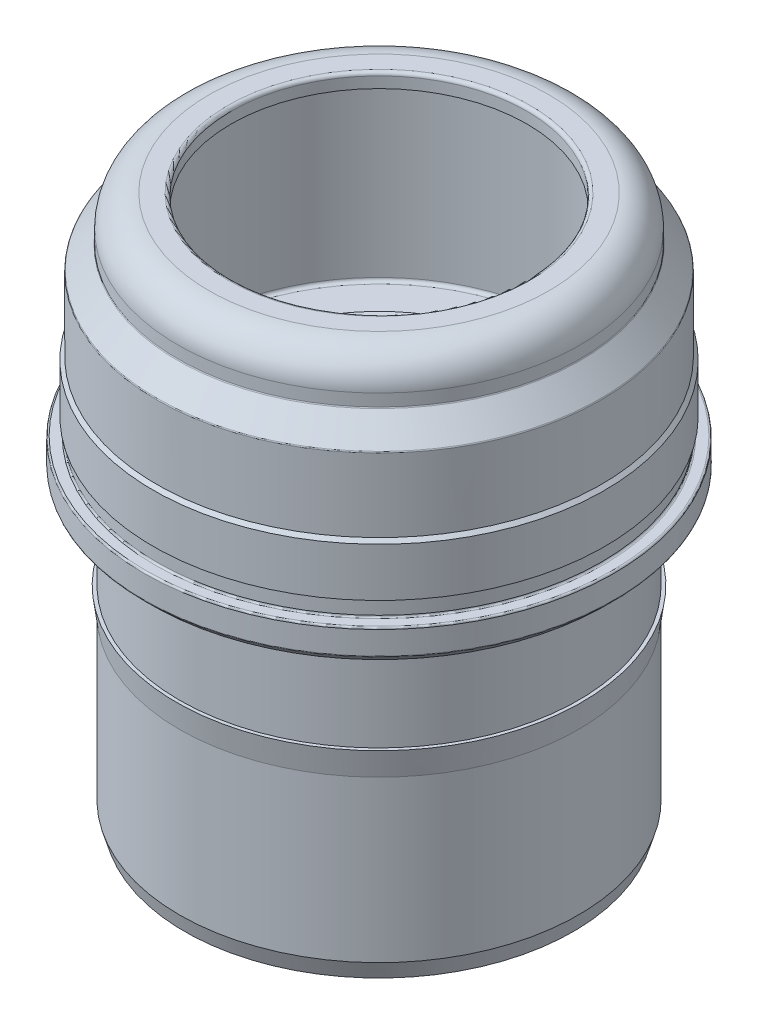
from build123d import *

# Parameters (mm, degrees)
CONG_1_R        = 0.2
CHANFREIN1_SIZE = 0.2
CONG_2_R        = 0.2
CONG_3_R        = 0.1


with BuildPart() as part:
    # Esquisse1 → R_volution1 (revolve)
    with BuildSketch(Plane.XY, mode=Mode.PRIVATE) as r_volution1_sk:
        with BuildLine():
            Line((8.675, 0), (11.5, 0))
            Line((11.5, 0), (11.8, 1))
            Line((11.8, 1), (11.8, 10.5))
            Line((11.8, 10.5), (12, 12))
            Line((12, 12), (11.8, 12))
            Line((11.8, 12), (11.8, 17.65))
            Line((11.8, 17.65), (13.4, 17.65))
            Line((13.4, 17.65), (13.9, 18.15))
            Line((13.9, 18.15), (13.9, 19.65))
            Line((13.9, 19.65), (13.15, 19.65))
            Line((13.15, 19.65), (13.15, 20.65))
            Line((13.15, 20.65), (13.35, 20.65))
            Line((13.35, 20.65), (13.35, 23.53))
            Line((13.35, 23.53), (13.15, 23.73))
            Line((13.15, 23.73), (13.15, 28.1))
            Line((13.15, 28.1), (11.9, 29.5))
            Line((11.9, 29.5), (11.9, 30.25))
            ThreePointArc((11.9, 30.25), (11.358147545, 31.558147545), (10.05, 32.1))
            Line((10.05, 32.1), (8.75, 32.1))
            Line((8.75, 32.1), (8.75, 31.25))
            Line((8.75, 31.25), (10.05, 31.25))
            ThreePointArc((10.05, 31.25), (10.757106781, 30.957106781), (11.05, 30.25))
            Line((11.05, 30.25), (11.05, 19.75))
            Line((11.05, 19.75), (8.675, 19.75))
            Line((8.675, 19.75), (8.675, 0))
        make_face()
    revolve(r_volution1_sk.sketch.rotate(Axis((0, 0, 0), (0, 1, 0)), 90), axis=Axis((0, 0, 0), (0, 1, 0)))

    # Cong_1
    cong_1_edges = [part.edges().sort_by_distance(p)[0] for p in [
        (0, 0, 8.675),
        (0, 32.1, 8.75),
    ]]
    fillet(cong_1_edges, radius=CONG_1_R)

    # Chanfrein1
    chanfrein1_edges = [part.edges().sort_by_distance(p)[0] for p in [
        (0, 19.75, 8.675),
    ]]
    chamfer(chanfrein1_edges, length=CHANFREIN1_SIZE)

    # Cong_2
    cong_2_edges = [part.edges().sort_by_distance(p)[0] for p in [
        (0, 19.75, 11.05),
    ]]
    fillet(cong_2_edges, radius=CONG_2_R)

    # Cong_3
    cong_3_edges = [part.edges().sort_by_distance(p)[0] for p in [
        (0, 17.65, 11.8),
        (0, 17.65, 13.4),
        (0, 18.15, 13.9),
        (0, 19.65, 13.9),
        (0, 19.65, 13.15),
        (0, 20.65, 13.15),
        (0, 28.1, 13.15),
        (0, 29.5, 11.9),
    ]]
    fillet(cong_3_edges, radius=CONG_3_R)


solid = part.part
